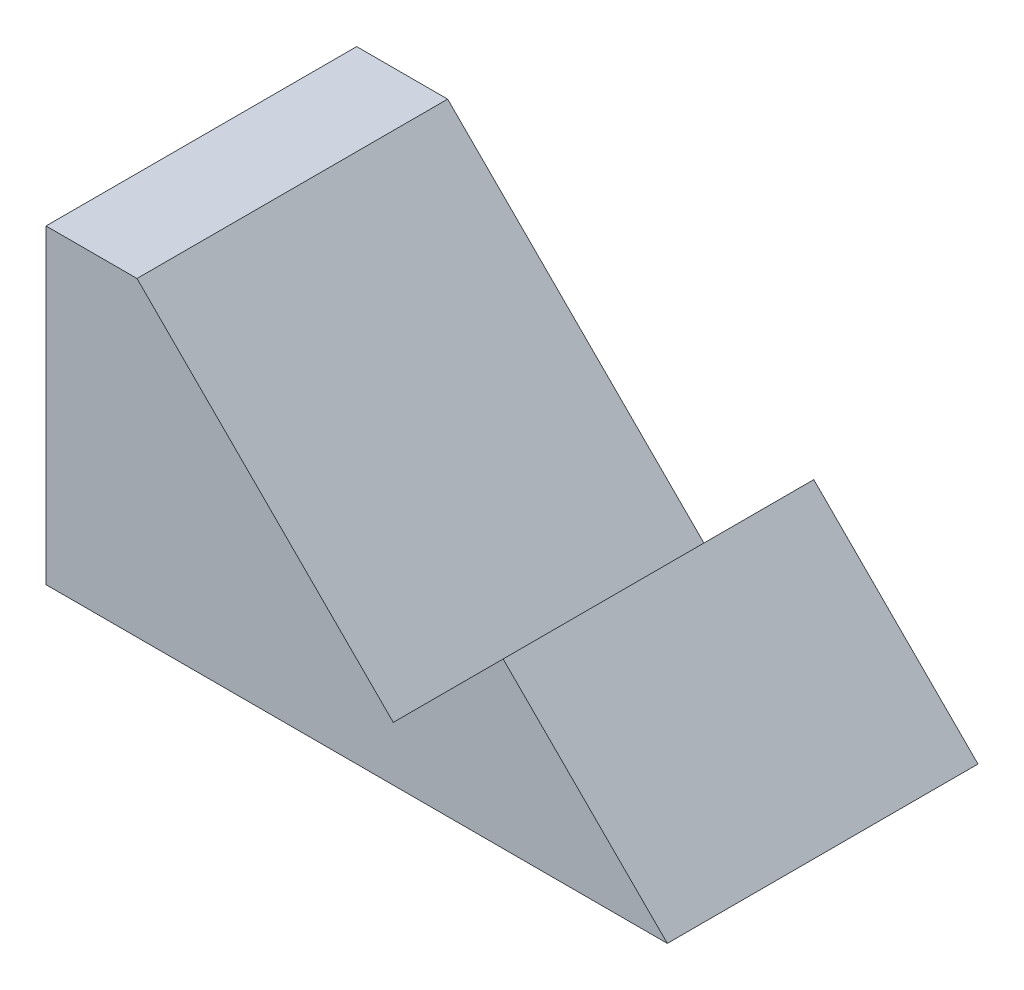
ISO-10303-21;
HEADER;
FILE_DESCRIPTION(('STEP AP214'),'2;1');
FILE_NAME('part.step','',(''),(''),'','','');
FILE_SCHEMA(('AUTOMOTIVE_DESIGN { 1 0 10303 214 1 1 1 1 }'));
ENDSEC;
DATA;
#1=APPLICATION_CONTEXT('core data for automotive mechanical design processes');
#2=APPLICATION_PROTOCOL_DEFINITION('international standard','automotive_design',2000,#1);
#3=PRODUCT_CONTEXT('',#1,'mechanical');
#4=PRODUCT('Part','Part','',(#3));
#5=PRODUCT_RELATED_PRODUCT_CATEGORY('part','',(#4));
#6=PRODUCT_DEFINITION_FORMATION('','',#4);
#7=PRODUCT_DEFINITION_CONTEXT('part definition',#1,'design');
#8=PRODUCT_DEFINITION('design','',#6,#7);
#9=PRODUCT_DEFINITION_SHAPE('','',#8);
#10=(LENGTH_UNIT() NAMED_UNIT(*) SI_UNIT(.MILLI.,.METRE.));
#11=(NAMED_UNIT(*) PLANE_ANGLE_UNIT() SI_UNIT($,.RADIAN.));
#12=(NAMED_UNIT(*) SI_UNIT($,.STERADIAN.) SOLID_ANGLE_UNIT());
#13=UNCERTAINTY_MEASURE_WITH_UNIT(LENGTH_MEASURE(1.E-05),#10,'distance_accuracy_value','');
#14=(GEOMETRIC_REPRESENTATION_CONTEXT(3) GLOBAL_UNCERTAINTY_ASSIGNED_CONTEXT((#13)) GLOBAL_UNIT_ASSIGNED_CONTEXT((#10,
#11,#12)) REPRESENTATION_CONTEXT('',''));
#15=CARTESIAN_POINT('',(0.,0.,0.));
#16=DIRECTION('',(0.,0.,1.));
#17=DIRECTION('',(1.,0.,0.));
#18=AXIS2_PLACEMENT_3D('',#15,#16,#17);
#19=CARTESIAN_POINT('',(0.,38.1,38.1));
#20=DIRECTION('',(1.,0.,0.));
#21=DIRECTION('',(0.,1.,0.));
#22=AXIS2_PLACEMENT_3D('',#19,#20,#21);
#23=PLANE('',#22);
#24=DIRECTION('',(0.,-1.,0.));
#25=VECTOR('',#24,1.);
#26=CARTESIAN_POINT('',(0.,38.1,0.));
#27=LINE('',#26,#25);
#28=CARTESIAN_POINT('',(0.,38.1,0.));
#29=VERTEX_POINT('',#28);
#30=CARTESIAN_POINT('',(0.,0.,0.));
#31=VERTEX_POINT('',#30);
#32=EDGE_CURVE('E114',#29,#31,#27,.T.);
#33=ORIENTED_EDGE('',*,*,#32,.T.);
#34=DIRECTION('',(0.,0.,-1.));
#35=VECTOR('',#34,1.);
#36=CARTESIAN_POINT('',(0.,0.,38.1));
#37=LINE('',#36,#35);
#38=CARTESIAN_POINT('',(0.,0.,38.1));
#39=VERTEX_POINT('',#38);
#40=EDGE_CURVE('E11',#39,#31,#37,.T.);
#41=ORIENTED_EDGE('',*,*,#40,.F.);
#42=DIRECTION('',(0.,-1.,0.));
#43=VECTOR('',#42,1.);
#44=CARTESIAN_POINT('',(0.,38.1,38.1));
#45=LINE('',#44,#43);
#46=CARTESIAN_POINT('',(0.,38.1,38.1));
#47=VERTEX_POINT('',#46);
#48=EDGE_CURVE('E124',#47,#39,#45,.T.);
#49=ORIENTED_EDGE('',*,*,#48,.F.);
#50=DIRECTION('',(0.,0.,-1.));
#51=VECTOR('',#50,1.);
#52=CARTESIAN_POINT('',(0.,38.1,38.1));
#53=LINE('',#52,#51);
#54=EDGE_CURVE('E110',#47,#29,#53,.T.);
#55=ORIENTED_EDGE('',*,*,#54,.T.);
#56=EDGE_LOOP('',(#33,#41,#49,#55));
#57=FACE_BOUND('',#56,.T.);
#58=ADVANCED_FACE('F30',(#57),#23,.F.);
#59=CARTESIAN_POINT('',(0.,0.,38.1));
#60=DIRECTION('',(0.,1.,0.));
#61=DIRECTION('',(0.,0.,1.));
#62=AXIS2_PLACEMENT_3D('',#59,#60,#61);
#63=PLANE('',#62);
#64=DIRECTION('',(1.,0.,0.));
#65=VECTOR('',#64,1.);
#66=CARTESIAN_POINT('',(0.,0.,0.));
#67=LINE('',#66,#65);
#68=CARTESIAN_POINT('',(76.2,0.,0.));
#69=VERTEX_POINT('',#68);
#70=EDGE_CURVE('E117',#31,#69,#67,.T.);
#71=ORIENTED_EDGE('',*,*,#70,.T.);
#72=DIRECTION('',(0.,0.,-1.));
#73=VECTOR('',#72,1.);
#74=CARTESIAN_POINT('',(76.2,0.,38.1));
#75=LINE('',#74,#73);
#76=CARTESIAN_POINT('',(76.2,0.,38.1));
#77=VERTEX_POINT('',#76);
#78=EDGE_CURVE('E38',#77,#69,#75,.T.);
#79=ORIENTED_EDGE('',*,*,#78,.F.);
#80=DIRECTION('',(1.,0.,0.));
#81=VECTOR('',#80,1.);
#82=CARTESIAN_POINT('',(0.,0.,38.1));
#83=LINE('',#82,#81);
#84=EDGE_CURVE('E83',#39,#77,#83,.T.);
#85=ORIENTED_EDGE('',*,*,#84,.F.);
#86=ORIENTED_EDGE('',*,*,#40,.T.);
#87=EDGE_LOOP('',(#71,#79,#85,#86));
#88=FACE_BOUND('',#87,.T.);
#89=ADVANCED_FACE('F148',(#88),#63,.F.);
#90=CARTESIAN_POINT('',(76.2,0.,38.1));
#91=DIRECTION('',(-0.707106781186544,-0.707106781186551,0.));
#92=DIRECTION('',(0.707106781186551,-0.707106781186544,0.));
#93=AXIS2_PLACEMENT_3D('',#90,#91,#92);
#94=PLANE('',#93);
#95=DIRECTION('',(-0.707106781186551,0.707106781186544,0.));
#96=VECTOR('',#95,1.);
#97=CARTESIAN_POINT('',(76.2,0.,0.));
#98=LINE('',#97,#96);
#99=CARTESIAN_POINT('',(56.0605122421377,20.139487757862,0.));
#100=VERTEX_POINT('',#99);
#101=EDGE_CURVE('E119',#69,#100,#98,.T.);
#102=ORIENTED_EDGE('',*,*,#101,.T.);
#103=DIRECTION('',(0.,0.,-1.));
#104=VECTOR('',#103,1.);
#105=CARTESIAN_POINT('',(56.0605122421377,20.139487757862,38.1));
#106=LINE('',#105,#104);
#107=CARTESIAN_POINT('',(56.0605122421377,20.139487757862,38.1));
#108=VERTEX_POINT('',#107);
#109=EDGE_CURVE('E105',#108,#100,#106,.T.);
#110=ORIENTED_EDGE('',*,*,#109,.F.);
#111=DIRECTION('',(-0.707106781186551,0.707106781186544,0.));
#112=VECTOR('',#111,1.);
#113=CARTESIAN_POINT('',(76.2,0.,38.1));
#114=LINE('',#113,#112);
#115=EDGE_CURVE('E96',#77,#108,#114,.T.);
#116=ORIENTED_EDGE('',*,*,#115,.F.);
#117=ORIENTED_EDGE('',*,*,#78,.T.);
#118=EDGE_LOOP('',(#102,#110,#116,#117));
#119=FACE_BOUND('',#118,.T.);
#120=ADVANCED_FACE('F130',(#119),#94,.F.);
#121=CARTESIAN_POINT('',(56.0605122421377,20.139487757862,38.1));
#122=DIRECTION('',(0.707106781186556,-0.707106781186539,0.));
#123=DIRECTION('',(0.707106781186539,0.707106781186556,0.));
#124=AXIS2_PLACEMENT_3D('',#121,#122,#123);
#125=PLANE('',#124);
#126=DIRECTION('',(-0.707106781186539,-0.707106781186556,0.));
#127=VECTOR('',#126,1.);
#128=CARTESIAN_POINT('',(56.0605122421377,20.139487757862,0.));
#129=LINE('',#128,#127);
#130=CARTESIAN_POINT('',(42.5901280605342,6.66910357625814,0.));
#131=VERTEX_POINT('',#130);
#132=EDGE_CURVE('E104',#100,#131,#129,.T.);
#133=ORIENTED_EDGE('',*,*,#132,.T.);
#134=DIRECTION('',(0.,0.,-1.));
#135=VECTOR('',#134,1.);
#136=CARTESIAN_POINT('',(42.5901280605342,6.66910357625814,38.1));
#137=LINE('',#136,#135);
#138=CARTESIAN_POINT('',(42.5901280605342,6.66910357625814,38.1));
#139=VERTEX_POINT('',#138);
#140=EDGE_CURVE('E101',#139,#131,#137,.T.);
#141=ORIENTED_EDGE('',*,*,#140,.F.);
#142=DIRECTION('',(-0.707106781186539,-0.707106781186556,0.));
#143=VECTOR('',#142,1.);
#144=CARTESIAN_POINT('',(56.0605122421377,20.139487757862,38.1));
#145=LINE('',#144,#143);
#146=EDGE_CURVE('E90',#108,#139,#145,.T.);
#147=ORIENTED_EDGE('',*,*,#146,.F.);
#148=ORIENTED_EDGE('',*,*,#109,.T.);
#149=EDGE_LOOP('',(#133,#141,#147,#148));
#150=FACE_BOUND('',#149,.T.);
#151=ADVANCED_FACE('F102',(#150),#125,.F.);
#152=CARTESIAN_POINT('',(42.5901280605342,6.66910357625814,38.1));
#153=DIRECTION('',(-0.707106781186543,-0.707106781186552,0.));
#154=DIRECTION('',(0.707106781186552,-0.707106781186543,0.));
#155=AXIS2_PLACEMENT_3D('',#152,#153,#154);
#156=PLANE('',#155);
#157=DIRECTION('',(-0.707106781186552,0.707106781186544,0.));
#158=VECTOR('',#157,1.);
#159=CARTESIAN_POINT('',(42.5901280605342,6.66910357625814,0.));
#160=LINE('',#159,#158);
#161=CARTESIAN_POINT('',(11.159231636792,38.1,0.));
#162=VERTEX_POINT('',#161);
#163=EDGE_CURVE('E69',#131,#162,#160,.T.);
#164=ORIENTED_EDGE('',*,*,#163,.T.);
#165=DIRECTION('',(0.,0.,-1.));
#166=VECTOR('',#165,1.);
#167=CARTESIAN_POINT('',(11.159231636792,38.1,38.1));
#168=LINE('',#167,#166);
#169=CARTESIAN_POINT('',(11.159231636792,38.1,38.1));
#170=VERTEX_POINT('',#169);
#171=EDGE_CURVE('E106',#170,#162,#168,.T.);
#172=ORIENTED_EDGE('',*,*,#171,.F.);
#173=DIRECTION('',(-0.707106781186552,0.707106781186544,0.));
#174=VECTOR('',#173,1.);
#175=CARTESIAN_POINT('',(42.5901280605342,6.66910357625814,38.1));
#176=LINE('',#175,#174);
#177=EDGE_CURVE('E94',#139,#170,#176,.T.);
#178=ORIENTED_EDGE('',*,*,#177,.F.);
#179=ORIENTED_EDGE('',*,*,#140,.T.);
#180=EDGE_LOOP('',(#164,#172,#178,#179));
#181=FACE_BOUND('',#180,.T.);
#182=ADVANCED_FACE('F108',(#181),#156,.F.);
#183=CARTESIAN_POINT('',(11.159231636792,38.1,38.1));
#184=DIRECTION('',(0.,-1.,0.));
#185=DIRECTION('',(1.,0.,0.));
#186=AXIS2_PLACEMENT_3D('',#183,#184,#185);
#187=PLANE('',#186);
#188=DIRECTION('',(-1.,0.,0.));
#189=VECTOR('',#188,1.);
#190=CARTESIAN_POINT('',(11.159231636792,38.1,0.));
#191=LINE('',#190,#189);
#192=EDGE_CURVE('E75',#162,#29,#191,.T.);
#193=ORIENTED_EDGE('',*,*,#192,.T.);
#194=ORIENTED_EDGE('',*,*,#54,.F.);
#195=DIRECTION('',(-1.,0.,0.));
#196=VECTOR('',#195,1.);
#197=CARTESIAN_POINT('',(11.159231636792,38.1,38.1));
#198=LINE('',#197,#196);
#199=EDGE_CURVE('E46',#170,#47,#198,.T.);
#200=ORIENTED_EDGE('',*,*,#199,.F.);
#201=ORIENTED_EDGE('',*,*,#171,.T.);
#202=EDGE_LOOP('',(#193,#194,#200,#201));
#203=FACE_BOUND('',#202,.T.);
#204=ADVANCED_FACE('F137',(#203),#187,.F.);
#205=CARTESIAN_POINT('',(0.,0.,38.1));
#206=DIRECTION('',(0.,0.,1.));
#207=DIRECTION('',(1.,0.,0.));
#208=AXIS2_PLACEMENT_3D('',#205,#206,#207);
#209=PLANE('',#208);
#210=ORIENTED_EDGE('',*,*,#48,.T.);
#211=ORIENTED_EDGE('',*,*,#84,.T.);
#212=ORIENTED_EDGE('',*,*,#115,.T.);
#213=ORIENTED_EDGE('',*,*,#146,.T.);
#214=ORIENTED_EDGE('',*,*,#177,.T.);
#215=ORIENTED_EDGE('',*,*,#199,.T.);
#216=EDGE_LOOP('',(#210,#211,#212,#213,#214,#215));
#217=FACE_BOUND('',#216,.T.);
#218=ADVANCED_FACE('F92',(#217),#209,.T.);
#219=CARTESIAN_POINT('',(0.,0.,0.));
#220=DIRECTION('',(0.,0.,1.));
#221=DIRECTION('',(1.,0.,0.));
#222=AXIS2_PLACEMENT_3D('',#219,#220,#221);
#223=PLANE('',#222);
#224=ORIENTED_EDGE('',*,*,#32,.F.);
#225=ORIENTED_EDGE('',*,*,#192,.F.);
#226=ORIENTED_EDGE('',*,*,#163,.F.);
#227=ORIENTED_EDGE('',*,*,#132,.F.);
#228=ORIENTED_EDGE('',*,*,#101,.F.);
#229=ORIENTED_EDGE('',*,*,#70,.F.);
#230=EDGE_LOOP('',(#224,#225,#226,#227,#228,#229));
#231=FACE_BOUND('',#230,.T.);
#232=ADVANCED_FACE('F133',(#231),#223,.F.);
#233=CLOSED_SHELL('',(#58,#89,#120,#151,#182,#204,#218,#232));
#234=MANIFOLD_SOLID_BREP('B2',#233);
#235=ADVANCED_BREP_SHAPE_REPRESENTATION('',(#18,#234),#14);
#236=SHAPE_DEFINITION_REPRESENTATION(#9,#235);
ENDSEC;
END-ISO-10303-21;
